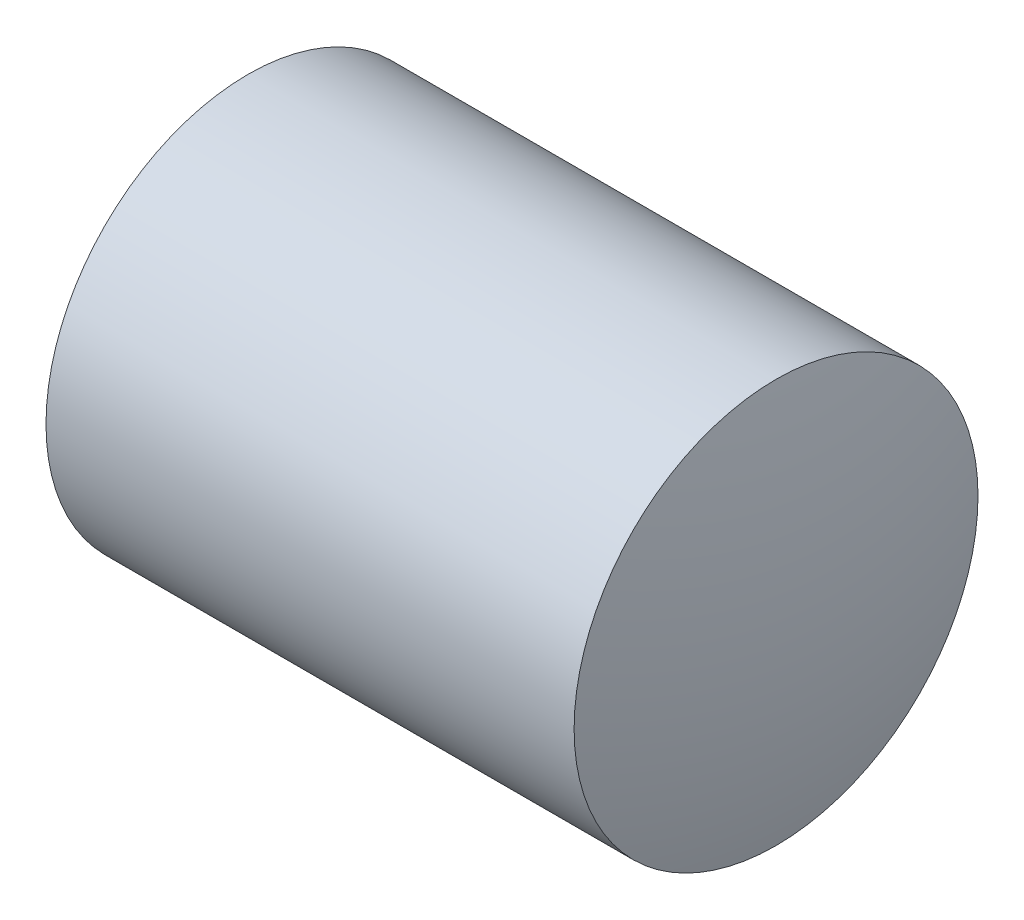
from build123d import *


with BuildPart() as part:
    # Skizze1 → Rotation1 (revolve)
    with BuildSketch(Plane.XY):
        with BuildLine():
            Line((17.5, 0), (24.655, 0))
            ThreePointArc((24.655, 0), (24.558855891, 1.512176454), (24.271971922, 3))
            Line((24.271971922, 3), (16.426515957, 3))
            ThreePointArc((16.426515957, 3), (17.223547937, 1.593139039), (17.5, 0))
        make_face()
    revolve(axis=Axis((17.5, 0, 0), (1, 0, 0)))


solid = part.part
